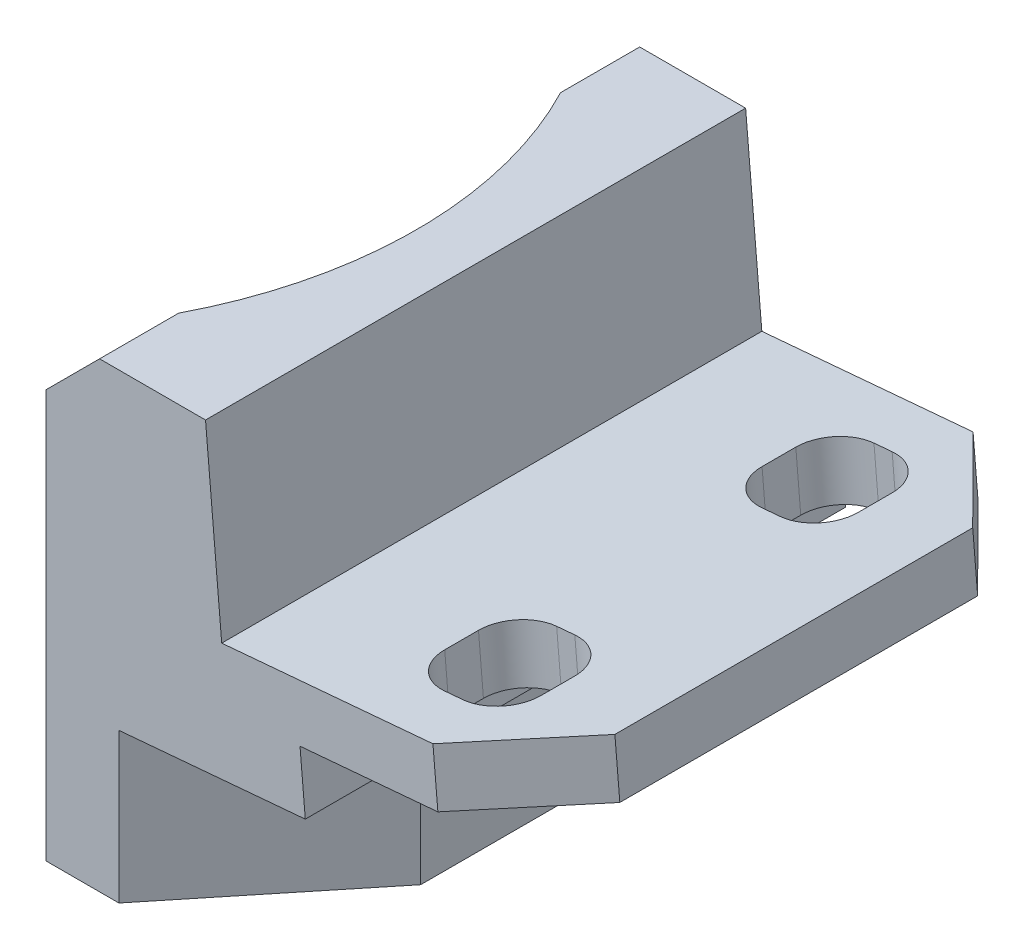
ISO-10303-21;
HEADER;
FILE_DESCRIPTION(('STEP AP214'),'2;1');
FILE_NAME('part.step','',(''),(''),'','','');
FILE_SCHEMA(('AUTOMOTIVE_DESIGN { 1 0 10303 214 1 1 1 1 }'));
ENDSEC;
DATA;
#1=APPLICATION_CONTEXT('core data for automotive mechanical design processes');
#2=APPLICATION_PROTOCOL_DEFINITION('international standard','automotive_design',2000,#1);
#3=PRODUCT_CONTEXT('',#1,'mechanical');
#4=PRODUCT('Part','Part','',(#3));
#5=PRODUCT_RELATED_PRODUCT_CATEGORY('part','',(#4));
#6=PRODUCT_DEFINITION_FORMATION('','',#4);
#7=PRODUCT_DEFINITION_CONTEXT('part definition',#1,'design');
#8=PRODUCT_DEFINITION('design','',#6,#7);
#9=PRODUCT_DEFINITION_SHAPE('','',#8);
#10=(LENGTH_UNIT() NAMED_UNIT(*) SI_UNIT(.MILLI.,.METRE.));
#11=(NAMED_UNIT(*) PLANE_ANGLE_UNIT() SI_UNIT($,.RADIAN.));
#12=(NAMED_UNIT(*) SI_UNIT($,.STERADIAN.) SOLID_ANGLE_UNIT());
#13=UNCERTAINTY_MEASURE_WITH_UNIT(LENGTH_MEASURE(1.E-05),#10,'distance_accuracy_value','');
#14=(GEOMETRIC_REPRESENTATION_CONTEXT(3) GLOBAL_UNCERTAINTY_ASSIGNED_CONTEXT((#13)) GLOBAL_UNIT_ASSIGNED_CONTEXT((#10,
#11,#12)) REPRESENTATION_CONTEXT('',''));
#15=CARTESIAN_POINT('',(0.,0.,0.));
#16=DIRECTION('',(0.,0.,1.));
#17=DIRECTION('',(1.,0.,0.));
#18=AXIS2_PLACEMENT_3D('',#15,#16,#17);
#19=CARTESIAN_POINT('',(20.1295,0.,10.16));
#20=DIRECTION('',(0.,0.,1.));
#21=DIRECTION('',(1.,0.,0.));
#22=AXIS2_PLACEMENT_3D('',#19,#20,#21);
#23=PLANE('',#22);
#24=DIRECTION('',(0.,-1.,0.));
#25=VECTOR('',#24,1.);
#26=CARTESIAN_POINT('',(12.3065392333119,0.,10.16));
#27=LINE('',#26,#25);
#28=CARTESIAN_POINT('',(12.3065392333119,-17.3675753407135,10.16));
#29=VERTEX_POINT('',#28);
#30=CARTESIAN_POINT('',(12.3065392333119,-2.01523509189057,10.16));
#31=VERTEX_POINT('',#30);
#32=EDGE_CURVE('E342',#29,#31,#27,.F.);
#33=ORIENTED_EDGE('',*,*,#32,.F.);
#34=DIRECTION('',(1.,0.,0.));
#35=VECTOR('',#34,1.);
#36=CARTESIAN_POINT('',(20.1295,-17.3675753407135,10.16));
#37=LINE('',#36,#35);
#38=CARTESIAN_POINT('',(15.0495,-17.3675753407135,10.16));
#39=VERTEX_POINT('',#38);
#40=EDGE_CURVE('E61',#29,#39,#37,.T.);
#41=ORIENTED_EDGE('',*,*,#40,.T.);
#42=DIRECTION('',(0.,1.,0.));
#43=VECTOR('',#42,1.);
#44=CARTESIAN_POINT('',(15.0495,-11.2969753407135,10.16));
#45=LINE('',#44,#43);
#46=CARTESIAN_POINT('',(15.0495,-11.7414177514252,10.16));
#47=VERTEX_POINT('',#46);
#48=EDGE_CURVE('E553',#39,#47,#45,.T.);
#49=ORIENTED_EDGE('',*,*,#48,.T.);
#50=DIRECTION('',(0.996194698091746,0.0871557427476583,0.));
#51=VECTOR('',#50,1.);
#52=CARTESIAN_POINT('',(30.6645289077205,-10.3752797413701,10.16));
#53=LINE('',#52,#51);
#54=CARTESIAN_POINT('',(22.0613914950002,-11.1279567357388,10.16));
#55=VERTEX_POINT('',#54);
#56=EDGE_CURVE('E529',#47,#55,#53,.T.);
#57=ORIENTED_EDGE('',*,*,#56,.T.);
#58=DIRECTION('',(0.0871557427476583,-0.996194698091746,0.));
#59=VECTOR('',#58,1.);
#60=CARTESIAN_POINT('',(21.862153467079,-8.85065565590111,10.16));
#61=LINE('',#60,#59);
#62=CARTESIAN_POINT('',(21.862153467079,-8.85065565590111,10.16));
#63=VERTEX_POINT('',#62);
#64=EDGE_CURVE('E357',#63,#55,#61,.T.);
#65=ORIENTED_EDGE('',*,*,#64,.F.);
#66=DIRECTION('',(-0.996194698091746,-0.0871557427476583,0.));
#67=VECTOR('',#66,1.);
#68=CARTESIAN_POINT('',(21.862153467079,-8.85065565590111,10.16));
#69=LINE('',#68,#67);
#70=CARTESIAN_POINT('',(27.0493392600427,-8.39683570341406,10.16));
#71=VERTEX_POINT('',#70);
#72=EDGE_CURVE('E353',#71,#63,#69,.T.);
#73=ORIENTED_EDGE('',*,*,#72,.F.);
#74=DIRECTION('',(-0.0871557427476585,0.996194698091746,0.));
#75=VECTOR('',#74,1.);
#76=CARTESIAN_POINT('',(26.8633837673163,-6.27135469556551,10.16));
#77=LINE('',#76,#75);
#78=CARTESIAN_POINT('',(26.8633837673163,-6.27135469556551,10.16));
#79=VERTEX_POINT('',#78);
#80=EDGE_CURVE('E566',#71,#79,#77,.T.);
#81=ORIENTED_EDGE('',*,*,#80,.T.);
#82=DIRECTION('',(-0.996194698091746,-0.0871557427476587,0.));
#83=VECTOR('',#82,1.);
#84=CARTESIAN_POINT('',(20.1579972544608,-6.858,10.16));
#85=LINE('',#84,#83);
#86=CARTESIAN_POINT('',(18.9170817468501,-6.96656603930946,10.16));
#87=VERTEX_POINT('',#86);
#88=EDGE_CURVE('E533',#79,#87,#85,.T.);
#89=ORIENTED_EDGE('',*,*,#88,.T.);
#90=DIRECTION('',(0.0871557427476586,-0.996194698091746,0.));
#91=VECTOR('',#90,1.);
#92=CARTESIAN_POINT('',(18.2580153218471,0.566597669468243,10.16));
#93=LINE('',#92,#91);
#94=CARTESIAN_POINT('',(18.3075861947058,0.,10.16));
#95=VERTEX_POINT('',#94);
#96=EDGE_CURVE('E496',#95,#87,#93,.T.);
#97=ORIENTED_EDGE('',*,*,#96,.F.);
#98=DIRECTION('',(-1.,0.,0.));
#99=VECTOR('',#98,1.);
#100=CARTESIAN_POINT('',(15.5575,0.,10.16));
#101=LINE('',#100,#99);
#102=CARTESIAN_POINT('',(14.3217743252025,0.,10.16));
#103=VERTEX_POINT('',#102);
#104=EDGE_CURVE('E525',#95,#103,#101,.T.);
#105=ORIENTED_EDGE('',*,*,#104,.T.);
#106=DIRECTION('',(0.707106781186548,0.707106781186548,0.));
#107=VECTOR('',#106,1.);
#108=CARTESIAN_POINT('',(14.3217743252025,0.,10.16));
#109=LINE('',#108,#107);
#110=EDGE_CURVE('E503',#31,#103,#109,.T.);
#111=ORIENTED_EDGE('',*,*,#110,.F.);
#112=EDGE_LOOP('',(#33,#41,#49,#57,#65,#73,#81,#89,#97,#105,#111));
#113=FACE_BOUND('',#112,.T.);
#114=ADVANCED_FACE('F43',(#113),#23,.T.);
#115=CARTESIAN_POINT('',(20.1295,0.,-10.16));
#116=DIRECTION('',(0.,0.,1.));
#117=DIRECTION('',(1.,0.,0.));
#118=AXIS2_PLACEMENT_3D('',#115,#116,#117);
#119=PLANE('',#118);
#120=DIRECTION('',(1.,0.,0.));
#121=VECTOR('',#120,1.);
#122=CARTESIAN_POINT('',(20.1295,-17.3675753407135,-10.16));
#123=LINE('',#122,#121);
#124=CARTESIAN_POINT('',(12.3065392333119,-17.3675753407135,-10.16));
#125=VERTEX_POINT('',#124);
#126=CARTESIAN_POINT('',(15.0495,-17.3675753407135,-10.16));
#127=VERTEX_POINT('',#126);
#128=EDGE_CURVE('E316',#125,#127,#123,.T.);
#129=ORIENTED_EDGE('',*,*,#128,.F.);
#130=DIRECTION('',(0.,-1.,0.));
#131=VECTOR('',#130,1.);
#132=CARTESIAN_POINT('',(12.3065392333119,0.,-10.16));
#133=LINE('',#132,#131);
#134=CARTESIAN_POINT('',(12.3065392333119,-2.01523509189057,-10.16));
#135=VERTEX_POINT('',#134);
#136=EDGE_CURVE('E324',#125,#135,#133,.F.);
#137=ORIENTED_EDGE('',*,*,#136,.T.);
#138=DIRECTION('',(0.707106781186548,0.707106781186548,0.));
#139=VECTOR('',#138,1.);
#140=CARTESIAN_POINT('',(14.3217743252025,0.,-10.16));
#141=LINE('',#140,#139);
#142=CARTESIAN_POINT('',(14.3217743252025,0.,-10.16));
#143=VERTEX_POINT('',#142);
#144=EDGE_CURVE('E507',#135,#143,#141,.T.);
#145=ORIENTED_EDGE('',*,*,#144,.T.);
#146=DIRECTION('',(-1.,0.,0.));
#147=VECTOR('',#146,1.);
#148=CARTESIAN_POINT('',(15.5575,0.,-10.16));
#149=LINE('',#148,#147);
#150=CARTESIAN_POINT('',(18.3075861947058,0.,-10.16));
#151=VERTEX_POINT('',#150);
#152=EDGE_CURVE('E515',#151,#143,#149,.T.);
#153=ORIENTED_EDGE('',*,*,#152,.F.);
#154=DIRECTION('',(-0.0871557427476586,0.996194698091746,0.));
#155=VECTOR('',#154,1.);
#156=CARTESIAN_POINT('',(18.321425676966,-0.158186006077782,-10.16));
#157=LINE('',#156,#155);
#158=CARTESIAN_POINT('',(18.9170817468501,-6.96656603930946,-10.16));
#159=VERTEX_POINT('',#158);
#160=EDGE_CURVE('E563',#159,#151,#157,.T.);
#161=ORIENTED_EDGE('',*,*,#160,.F.);
#162=DIRECTION('',(-0.996194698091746,-0.0871557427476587,0.));
#163=VECTOR('',#162,1.);
#164=CARTESIAN_POINT('',(20.1579972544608,-6.858,-10.16));
#165=LINE('',#164,#163);
#166=CARTESIAN_POINT('',(26.8633837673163,-6.27135469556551,-10.16));
#167=VERTEX_POINT('',#166);
#168=EDGE_CURVE('E522',#167,#159,#165,.T.);
#169=ORIENTED_EDGE('',*,*,#168,.F.);
#170=DIRECTION('',(0.0871557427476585,-0.996194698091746,0.));
#171=VECTOR('',#170,1.);
#172=CARTESIAN_POINT('',(26.2677276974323,0.537025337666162,-10.16));
#173=LINE('',#172,#171);
#174=CARTESIAN_POINT('',(27.0493392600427,-8.39683570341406,-10.16));
#175=VERTEX_POINT('',#174);
#176=EDGE_CURVE('E582',#167,#175,#173,.T.);
#177=ORIENTED_EDGE('',*,*,#176,.T.);
#178=DIRECTION('',(0.996194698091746,0.0871557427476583,0.));
#179=VECTOR('',#178,1.);
#180=CARTESIAN_POINT('',(21.862153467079,-8.85065565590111,-10.16));
#181=LINE('',#180,#179);
#182=CARTESIAN_POINT('',(21.862153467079,-8.85065565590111,-10.16));
#183=VERTEX_POINT('',#182);
#184=EDGE_CURVE('E70',#183,#175,#181,.T.);
#185=ORIENTED_EDGE('',*,*,#184,.F.);
#186=DIRECTION('',(0.0871557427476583,-0.996194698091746,0.));
#187=VECTOR('',#186,1.);
#188=CARTESIAN_POINT('',(21.862153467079,-8.85065565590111,-10.16));
#189=LINE('',#188,#187);
#190=CARTESIAN_POINT('',(22.0613914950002,-11.1279567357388,-10.16));
#191=VERTEX_POINT('',#190);
#192=EDGE_CURVE('E355',#183,#191,#189,.T.);
#193=ORIENTED_EDGE('',*,*,#192,.T.);
#194=DIRECTION('',(0.996194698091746,0.0871557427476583,0.));
#195=VECTOR('',#194,1.);
#196=CARTESIAN_POINT('',(30.6645289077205,-10.3752797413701,-10.16));
#197=LINE('',#196,#195);
#198=CARTESIAN_POINT('',(15.0495,-11.7414177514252,-10.16));
#199=VERTEX_POINT('',#198);
#200=EDGE_CURVE('E519',#199,#191,#197,.T.);
#201=ORIENTED_EDGE('',*,*,#200,.F.);
#202=DIRECTION('',(0.,-1.,0.));
#203=VECTOR('',#202,1.);
#204=CARTESIAN_POINT('',(15.0495,0.,-10.16));
#205=LINE('',#204,#203);
#206=EDGE_CURVE('E327',#199,#127,#205,.T.);
#207=ORIENTED_EDGE('',*,*,#206,.T.);
#208=EDGE_LOOP('',(#129,#137,#145,#153,#161,#169,#177,#185,#193,#201,#207));
#209=FACE_BOUND('',#208,.T.);
#210=ADVANCED_FACE('F323',(#209),#119,.F.);
#211=CARTESIAN_POINT('',(20.1295,-19.4757753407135,10.16));
#212=DIRECTION('',(-1.,0.,0.));
#213=DIRECTION('',(0.,0.,1.));
#214=AXIS2_PLACEMENT_3D('',#211,#212,#213);
#215=PLANE('',#214);
#216=DIRECTION('',(0.,0.,1.));
#217=VECTOR('',#216,1.);
#218=CARTESIAN_POINT('',(20.1295,-17.3675753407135,10.16));
#219=LINE('',#218,#217);
#220=CARTESIAN_POINT('',(20.1295,-17.3675753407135,-3.88672244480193));
#221=VERTEX_POINT('',#220);
#222=CARTESIAN_POINT('',(20.1295,-17.3675753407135,3.88672244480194));
#223=VERTEX_POINT('',#222);
#224=EDGE_CURVE('E746',#221,#223,#219,.T.);
#225=ORIENTED_EDGE('',*,*,#224,.F.);
#226=DIRECTION('',(0.,1.,0.));
#227=VECTOR('',#226,1.);
#228=CARTESIAN_POINT('',(20.1295,-19.4757753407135,-3.88672244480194));
#229=LINE('',#228,#227);
#230=CARTESIAN_POINT('',(20.1295,-11.2969753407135,-3.88672244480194));
#231=VERTEX_POINT('',#230);
#232=EDGE_CURVE('E544',#221,#231,#229,.T.);
#233=ORIENTED_EDGE('',*,*,#232,.T.);
#234=DIRECTION('',(0.,0.,-1.));
#235=VECTOR('',#234,1.);
#236=CARTESIAN_POINT('',(20.1295,-11.2969753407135,10.16));
#237=LINE('',#236,#235);
#238=CARTESIAN_POINT('',(20.1295,-11.2969753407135,3.88672244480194));
#239=VERTEX_POINT('',#238);
#240=EDGE_CURVE('E540',#239,#231,#237,.T.);
#241=ORIENTED_EDGE('',*,*,#240,.F.);
#242=DIRECTION('',(0.,-1.,0.));
#243=VECTOR('',#242,1.);
#244=CARTESIAN_POINT('',(20.1295,-19.4757753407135,3.88672244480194));
#245=LINE('',#244,#243);
#246=EDGE_CURVE('E556',#239,#223,#245,.T.);
#247=ORIENTED_EDGE('',*,*,#246,.T.);
#248=EDGE_LOOP('',(#225,#233,#241,#247));
#249=FACE_BOUND('',#248,.T.);
#250=ADVANCED_FACE('F690',(#249),#215,.F.);
#251=CARTESIAN_POINT('',(20.1295,-19.4757753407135,-3.88672244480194));
#252=DIRECTION('',(-0.77714596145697,0.,0.629320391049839));
#253=DIRECTION('',(0.629320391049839,0.,0.77714596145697));
#254=AXIS2_PLACEMENT_3D('',#251,#252,#253);
#255=PLANE('',#254);
#256=ORIENTED_EDGE('',*,*,#232,.F.);
#257=DIRECTION('',(0.629320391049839,0.,0.77714596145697));
#258=VECTOR('',#257,1.);
#259=CARTESIAN_POINT('',(20.1295,-17.3675753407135,-3.88672244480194));
#260=LINE('',#259,#258);
#261=EDGE_CURVE('E743',#221,#127,#260,.F.);
#262=ORIENTED_EDGE('',*,*,#261,.T.);
#263=ORIENTED_EDGE('',*,*,#206,.F.);
#264=DIRECTION('',(0.628368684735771,0.0549751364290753,0.775970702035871));
#265=VECTOR('',#264,1.);
#266=CARTESIAN_POINT('',(31.1701876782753,-10.3310403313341,9.74739137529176));
#267=LINE('',#266,#265);
#268=EDGE_CURVE('E549',#231,#199,#267,.F.);
#269=ORIENTED_EDGE('',*,*,#268,.F.);
#270=EDGE_LOOP('',(#256,#262,#263,#269));
#271=FACE_BOUND('',#270,.T.);
#272=ADVANCED_FACE('F709',(#271),#255,.F.);
#273=CARTESIAN_POINT('',(15.0495,0.,10.16));
#274=DIRECTION('',(0.77714596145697,0.,0.629320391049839));
#275=DIRECTION('',(0.629320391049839,0.,-0.77714596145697));
#276=AXIS2_PLACEMENT_3D('',#273,#274,#275);
#277=PLANE('',#276);
#278=ORIENTED_EDGE('',*,*,#48,.F.);
#279=DIRECTION('',(0.629320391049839,0.,-0.77714596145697));
#280=VECTOR('',#279,1.);
#281=CARTESIAN_POINT('',(15.0495,-17.3675753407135,10.16));
#282=LINE('',#281,#280);
#283=EDGE_CURVE('E747',#39,#223,#282,.T.);
#284=ORIENTED_EDGE('',*,*,#283,.T.);
#285=ORIENTED_EDGE('',*,*,#246,.F.);
#286=DIRECTION('',(0.628368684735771,0.0549751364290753,-0.775970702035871));
#287=VECTOR('',#286,1.);
#288=CARTESIAN_POINT('',(21.2622432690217,-11.1978731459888,2.48790100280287));
#289=LINE('',#288,#287);
#290=EDGE_CURVE('E560',#47,#239,#289,.T.);
#291=ORIENTED_EDGE('',*,*,#290,.F.);
#292=EDGE_LOOP('',(#278,#284,#285,#291));
#293=FACE_BOUND('',#292,.T.);
#294=ADVANCED_FACE('F717',(#293),#277,.T.);
#295=CARTESIAN_POINT('',(0.508,0.,0.));
#296=DIRECTION('',(0.,-1.,0.));
#297=DIRECTION('',(0.,0.,-1.));
#298=AXIS2_PLACEMENT_3D('',#295,#296,#297);
#299=CYLINDRICAL_SURFACE('',#298,15.5702);
#300=CARTESIAN_POINT('',(0.508,-17.3675753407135,0.));
#301=DIRECTION('',(0.,-1.,0.));
#302=DIRECTION('',(1.,0.,0.));
#303=AXIS2_PLACEMENT_3D('',#300,#301,#302);
#304=CIRCLE('',#303,15.5702);
#305=EDGE_CURVE('E11',#29,#125,#304,.F.);
#306=ORIENTED_EDGE('',*,*,#305,.F.);
#307=ORIENTED_EDGE('',*,*,#32,.T.);
#308=CARTESIAN_POINT('',(0.508,-13.8137743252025,0.));
#309=DIRECTION('',(0.707106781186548,-0.707106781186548,0.));
#310=DIRECTION('',(-0.707106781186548,-0.707106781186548,0.));
#311=AXIS2_PLACEMENT_3D('',#308,#309,#310);
#312=ELLIPSE('',#311,22.0195880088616,15.5702);
#313=CARTESIAN_POINT('',(14.3217743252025,0.,7.18406339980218));
#314=VERTEX_POINT('',#313);
#315=EDGE_CURVE('E759',#314,#31,#312,.T.);
#316=ORIENTED_EDGE('',*,*,#315,.F.);
#317=CARTESIAN_POINT('',(0.508,0.,0.));
#318=DIRECTION('',(0.,-1.,0.));
#319=DIRECTION('',(0.,0.,-1.));
#320=AXIS2_PLACEMENT_3D('',#317,#318,#319);
#321=CIRCLE('',#320,15.5702);
#322=CARTESIAN_POINT('',(14.3217743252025,0.,-7.18406339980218));
#323=VERTEX_POINT('',#322);
#324=EDGE_CURVE('E750',#323,#314,#321,.T.);
#325=ORIENTED_EDGE('',*,*,#324,.F.);
#326=CARTESIAN_POINT('',(0.508,-13.8137743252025,0.));
#327=DIRECTION('',(0.707106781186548,-0.707106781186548,0.));
#328=DIRECTION('',(-0.707106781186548,-0.707106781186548,0.));
#329=AXIS2_PLACEMENT_3D('',#326,#327,#328);
#330=ELLIPSE('',#329,22.0195880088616,15.5702);
#331=EDGE_CURVE('E332',#135,#323,#330,.T.);
#332=ORIENTED_EDGE('',*,*,#331,.F.);
#333=ORIENTED_EDGE('',*,*,#136,.F.);
#334=EDGE_LOOP('',(#306,#307,#316,#325,#332,#333));
#335=FACE_BOUND('',#334,.T.);
#336=ADVANCED_FACE('F330',(#335),#299,.F.);
#337=CARTESIAN_POINT('',(30.2793353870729,-5.97249765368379,10.16));
#338=DIRECTION('',(-0.996194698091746,-0.0871557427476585,0.));
#339=DIRECTION('',(0.0871557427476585,-0.996194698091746,0.));
#340=AXIS2_PLACEMENT_3D('',#337,#338,#339);
#341=PLANE('',#340);
#342=DIRECTION('',(0.,0.,1.));
#343=VECTOR('',#342,1.);
#344=CARTESIAN_POINT('',(30.4652908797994,-8.09797866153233,10.16));
#345=LINE('',#344,#343);
#346=CARTESIAN_POINT('',(30.4652908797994,-8.09797866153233,-6.73099999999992));
#347=VERTEX_POINT('',#346);
#348=CARTESIAN_POINT('',(30.4652908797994,-8.09797866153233,6.73099999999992));
#349=VERTEX_POINT('',#348);
#350=EDGE_CURVE('E350',#347,#349,#345,.T.);
#351=ORIENTED_EDGE('',*,*,#350,.F.);
#352=DIRECTION('',(-0.0871557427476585,0.996194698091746,0.));
#353=VECTOR('',#352,1.);
#354=CARTESIAN_POINT('',(30.2793353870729,-5.97249765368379,-6.731));
#355=LINE('',#354,#353);
#356=CARTESIAN_POINT('',(30.2793353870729,-5.97249765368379,-6.73099999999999));
#357=VERTEX_POINT('',#356);
#358=EDGE_CURVE('E575',#347,#357,#355,.T.);
#359=ORIENTED_EDGE('',*,*,#358,.T.);
#360=DIRECTION('',(0.,0.,-1.));
#361=VECTOR('',#360,1.);
#362=CARTESIAN_POINT('',(30.2793353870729,-5.97249765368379,10.16));
#363=LINE('',#362,#361);
#364=CARTESIAN_POINT('',(30.2793353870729,-5.97249765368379,6.73099999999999));
#365=VERTEX_POINT('',#364);
#366=EDGE_CURVE('E536',#365,#357,#363,.T.);
#367=ORIENTED_EDGE('',*,*,#366,.F.);
#368=DIRECTION('',(0.0871557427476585,-0.996194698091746,0.));
#369=VECTOR('',#368,1.);
#370=CARTESIAN_POINT('',(30.6645289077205,-10.3752797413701,6.73099999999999));
#371=LINE('',#370,#369);
#372=EDGE_CURVE('E578',#365,#349,#371,.T.);
#373=ORIENTED_EDGE('',*,*,#372,.T.);
#374=EDGE_LOOP('',(#351,#359,#367,#373));
#375=FACE_BOUND('',#374,.T.);
#376=ADVANCED_FACE('F699',(#375),#341,.F.);
#377=CARTESIAN_POINT('',(26.2677276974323,0.537025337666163,10.16));
#378=DIRECTION('',(0.70441602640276,0.0616284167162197,0.707106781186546));
#379=DIRECTION('',(0.708453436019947,0.,-0.705757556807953));
#380=AXIS2_PLACEMENT_3D('',#377,#378,#379);
#381=PLANE('',#380);
#382=ORIENTED_EDGE('',*,*,#80,.F.);
#383=DIRECTION('',(0.704416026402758,0.0616284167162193,-0.707106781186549));
#384=VECTOR('',#383,1.);
#385=CARTESIAN_POINT('',(27.0493392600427,-8.39683570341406,10.16));
#386=LINE('',#385,#384);
#387=EDGE_CURVE('E418',#71,#349,#386,.T.);
#388=ORIENTED_EDGE('',*,*,#387,.T.);
#389=ORIENTED_EDGE('',*,*,#372,.F.);
#390=DIRECTION('',(0.704416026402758,0.0616284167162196,-0.707106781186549));
#391=VECTOR('',#390,1.);
#392=CARTESIAN_POINT('',(26.8633837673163,-6.27135469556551,10.16));
#393=LINE('',#392,#391);
#394=EDGE_CURVE('E572',#79,#365,#393,.T.);
#395=ORIENTED_EDGE('',*,*,#394,.F.);
#396=EDGE_LOOP('',(#382,#388,#389,#395));
#397=FACE_BOUND('',#396,.T.);
#398=ADVANCED_FACE('F702',(#397),#381,.T.);
#399=CARTESIAN_POINT('',(30.2793353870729,-5.97249765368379,-6.731));
#400=DIRECTION('',(-0.704416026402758,-0.0616284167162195,0.707106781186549));
#401=DIRECTION('',(0.708453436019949,0.,0.705757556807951));
#402=AXIS2_PLACEMENT_3D('',#399,#400,#401);
#403=PLANE('',#402);
#404=ORIENTED_EDGE('',*,*,#358,.F.);
#405=DIRECTION('',(0.70441602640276,0.0616284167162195,0.707106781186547));
#406=VECTOR('',#405,1.);
#407=CARTESIAN_POINT('',(30.4652908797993,-8.09797866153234,-6.731));
#408=LINE('',#407,#406);
#409=EDGE_CURVE('E415',#347,#175,#408,.F.);
#410=ORIENTED_EDGE('',*,*,#409,.T.);
#411=ORIENTED_EDGE('',*,*,#176,.F.);
#412=DIRECTION('',(0.70441602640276,0.0616284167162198,0.707106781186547));
#413=VECTOR('',#412,1.);
#414=CARTESIAN_POINT('',(30.2793353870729,-5.97249765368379,-6.731));
#415=LINE('',#414,#413);
#416=EDGE_CURVE('E569',#357,#167,#415,.F.);
#417=ORIENTED_EDGE('',*,*,#416,.F.);
#418=EDGE_LOOP('',(#404,#410,#411,#417));
#419=FACE_BOUND('',#418,.T.);
#420=ADVANCED_FACE('F45',(#419),#403,.F.);
#421=CARTESIAN_POINT('',(25.2427902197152,1.17768629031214,6.604));
#422=DIRECTION('',(0.0871557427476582,-0.996194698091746,0.));
#423=DIRECTION('',(0.996194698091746,0.0871557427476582,0.));
#424=AXIS2_PLACEMENT_3D('',#421,#422,#423);
#425=CYLINDRICAL_SURFACE('',#424,1.4732);
#426=CARTESIAN_POINT('',(26.0878121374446,-8.4809584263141,6.604));
#427=DIRECTION('',(0.0871557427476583,-0.996194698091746,0.));
#428=DIRECTION('',(0.996194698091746,0.0871557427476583,0.));
#429=AXIS2_PLACEMENT_3D('',#426,#427,#428);
#430=CIRCLE('',#429,1.4732);
#431=CARTESIAN_POINT('',(26.0878121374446,-8.4809584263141,8.0772));
#432=VERTEX_POINT('',#431);
#433=CARTESIAN_POINT('',(27.5554061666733,-8.35256058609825,6.60399999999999));
#434=VERTEX_POINT('',#433);
#435=EDGE_CURVE('E409',#432,#434,#430,.F.);
#436=ORIENTED_EDGE('',*,*,#435,.F.);
#437=DIRECTION('',(0.0871557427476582,-0.996194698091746,0.));
#438=VECTOR('',#437,1.);
#439=CARTESIAN_POINT('',(25.2427902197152,1.17768629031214,8.0772));
#440=LINE('',#439,#438);
#441=CARTESIAN_POINT('',(25.9018566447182,-6.35547741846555,8.0772));
#442=VERTEX_POINT('',#441);
#443=EDGE_CURVE('E457',#442,#432,#440,.T.);
#444=ORIENTED_EDGE('',*,*,#443,.F.);
#445=CARTESIAN_POINT('',(25.9018566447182,-6.35547741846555,6.604));
#446=DIRECTION('',(0.0871557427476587,-0.996194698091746,0.));
#447=DIRECTION('',(0.996194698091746,0.0871557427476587,0.));
#448=AXIS2_PLACEMENT_3D('',#445,#446,#447);
#449=CIRCLE('',#448,1.4732);
#450=CARTESIAN_POINT('',(27.3694506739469,-6.2270795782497,6.60399999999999));
#451=VERTEX_POINT('',#450);
#452=EDGE_CURVE('E594',#451,#442,#449,.T.);
#453=ORIENTED_EDGE('',*,*,#452,.F.);
#454=DIRECTION('',(0.0871557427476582,-0.996194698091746,0.));
#455=VECTOR('',#454,1.);
#456=CARTESIAN_POINT('',(26.710384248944,1.30608413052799,6.60399999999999));
#457=LINE('',#456,#455);
#458=EDGE_CURVE('E458',#451,#434,#457,.T.);
#459=ORIENTED_EDGE('',*,*,#458,.T.);
#460=EDGE_LOOP('',(#436,#444,#453,#459));
#461=FACE_BOUND('',#460,.T.);
#462=ADVANCED_FACE('F726',(#461),#425,.F.);
#463=CARTESIAN_POINT('',(26.710384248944,1.30608413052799,6.60399999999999));
#464=DIRECTION('',(0.996194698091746,0.0871557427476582,0.));
#465=DIRECTION('',(-0.0871557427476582,0.996194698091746,0.));
#466=AXIS2_PLACEMENT_3D('',#463,#464,#465);
#467=PLANE('',#466);
#468=DIRECTION('',(0.,0.,-1.));
#469=VECTOR('',#468,1.);
#470=CARTESIAN_POINT('',(27.5554061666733,-8.35256058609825,6.60399999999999));
#471=LINE('',#470,#469);
#472=CARTESIAN_POINT('',(27.5554061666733,-8.35256058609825,5.33400000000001));
#473=VERTEX_POINT('',#472);
#474=EDGE_CURVE('E406',#434,#473,#471,.T.);
#475=ORIENTED_EDGE('',*,*,#474,.F.);
#476=ORIENTED_EDGE('',*,*,#458,.F.);
#477=DIRECTION('',(0.,0.,1.));
#478=VECTOR('',#477,1.);
#479=CARTESIAN_POINT('',(27.3694506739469,-6.2270795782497,10.16));
#480=LINE('',#479,#478);
#481=CARTESIAN_POINT('',(27.3694506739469,-6.2270795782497,5.33400000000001));
#482=VERTEX_POINT('',#481);
#483=EDGE_CURVE('E610',#482,#451,#480,.T.);
#484=ORIENTED_EDGE('',*,*,#483,.F.);
#485=DIRECTION('',(0.0871557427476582,-0.996194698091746,0.));
#486=VECTOR('',#485,1.);
#487=CARTESIAN_POINT('',(26.710384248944,1.30608413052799,5.33400000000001));
#488=LINE('',#487,#486);
#489=EDGE_CURVE('E463',#482,#473,#488,.T.);
#490=ORIENTED_EDGE('',*,*,#489,.T.);
#491=EDGE_LOOP('',(#475,#476,#484,#490));
#492=FACE_BOUND('',#491,.T.);
#493=ADVANCED_FACE('F818',(#492),#467,.F.);
#494=CARTESIAN_POINT('',(25.2427902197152,1.17768629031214,5.334));
#495=DIRECTION('',(0.0871557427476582,-0.996194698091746,0.));
#496=DIRECTION('',(0.996194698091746,0.0871557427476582,0.));
#497=AXIS2_PLACEMENT_3D('',#494,#495,#496);
#498=CYLINDRICAL_SURFACE('',#497,1.4732);
#499=CARTESIAN_POINT('',(26.0878121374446,-8.4809584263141,5.334));
#500=DIRECTION('',(0.0871557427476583,-0.996194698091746,0.));
#501=DIRECTION('',(0.996194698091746,0.0871557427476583,0.));
#502=AXIS2_PLACEMENT_3D('',#499,#500,#501);
#503=CIRCLE('',#502,1.4732);
#504=CARTESIAN_POINT('',(26.0878121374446,-8.4809584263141,3.8608));
#505=VERTEX_POINT('',#504);
#506=EDGE_CURVE('E403',#473,#505,#503,.F.);
#507=ORIENTED_EDGE('',*,*,#506,.F.);
#508=ORIENTED_EDGE('',*,*,#489,.F.);
#509=CARTESIAN_POINT('',(25.9018566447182,-6.35547741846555,5.334));
#510=DIRECTION('',(0.0871557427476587,-0.996194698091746,0.));
#511=DIRECTION('',(0.996194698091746,0.0871557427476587,0.));
#512=AXIS2_PLACEMENT_3D('',#509,#510,#511);
#513=CIRCLE('',#512,1.4732);
#514=CARTESIAN_POINT('',(25.9018566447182,-6.35547741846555,3.8608));
#515=VERTEX_POINT('',#514);
#516=EDGE_CURVE('E606',#515,#482,#513,.T.);
#517=ORIENTED_EDGE('',*,*,#516,.F.);
#518=DIRECTION('',(0.0871557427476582,-0.996194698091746,0.));
#519=VECTOR('',#518,1.);
#520=CARTESIAN_POINT('',(25.2427902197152,1.17768629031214,3.8608));
#521=LINE('',#520,#519);
#522=EDGE_CURVE('E467',#515,#505,#521,.T.);
#523=ORIENTED_EDGE('',*,*,#522,.T.);
#524=EDGE_LOOP('',(#507,#508,#517,#523));
#525=FACE_BOUND('',#524,.T.);
#526=ADVANCED_FACE('F792',(#525),#498,.F.);
#527=CARTESIAN_POINT('',(25.2427902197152,1.17768629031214,3.8608));
#528=DIRECTION('',(0.,0.,-1.));
#529=DIRECTION('',(-1.,0.,0.));
#530=AXIS2_PLACEMENT_3D('',#527,#528,#529);
#531=PLANE('',#530);
#532=DIRECTION('',(-0.996194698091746,-0.0871557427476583,0.));
#533=VECTOR('',#532,1.);
#534=CARTESIAN_POINT('',(26.0878121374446,-8.4809584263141,3.8608));
#535=LINE('',#534,#533);
#536=CARTESIAN_POINT('',(25.4046218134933,-8.54072983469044,3.8608));
#537=VERTEX_POINT('',#536);
#538=EDGE_CURVE('E400',#505,#537,#535,.T.);
#539=ORIENTED_EDGE('',*,*,#538,.F.);
#540=ORIENTED_EDGE('',*,*,#522,.F.);
#541=DIRECTION('',(0.996194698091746,0.0871557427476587,0.));
#542=VECTOR('',#541,1.);
#543=CARTESIAN_POINT('',(20.1579972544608,-6.858,3.8608));
#544=LINE('',#543,#542);
#545=CARTESIAN_POINT('',(25.2186663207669,-6.41524882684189,3.8608));
#546=VERTEX_POINT('',#545);
#547=EDGE_CURVE('E602',#546,#515,#544,.T.);
#548=ORIENTED_EDGE('',*,*,#547,.F.);
#549=DIRECTION('',(0.0871557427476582,-0.996194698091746,0.));
#550=VECTOR('',#549,1.);
#551=CARTESIAN_POINT('',(24.5595998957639,1.1179148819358,3.8608));
#552=LINE('',#551,#550);
#553=EDGE_CURVE('E471',#546,#537,#552,.T.);
#554=ORIENTED_EDGE('',*,*,#553,.T.);
#555=EDGE_LOOP('',(#539,#540,#548,#554));
#556=FACE_BOUND('',#555,.T.);
#557=ADVANCED_FACE('F795',(#556),#531,.F.);
#558=CARTESIAN_POINT('',(24.5595998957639,1.1179148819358,5.334));
#559=DIRECTION('',(0.0871557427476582,-0.996194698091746,0.));
#560=DIRECTION('',(0.996194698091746,0.0871557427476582,0.));
#561=AXIS2_PLACEMENT_3D('',#558,#559,#560);
#562=CYLINDRICAL_SURFACE('',#561,1.4732);
#563=CARTESIAN_POINT('',(25.4046218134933,-8.54072983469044,5.334));
#564=DIRECTION('',(0.0871557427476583,-0.996194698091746,0.));
#565=DIRECTION('',(0.996194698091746,0.0871557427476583,0.));
#566=AXIS2_PLACEMENT_3D('',#563,#564,#565);
#567=CIRCLE('',#566,1.4732);
#568=CARTESIAN_POINT('',(23.9370277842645,-8.66912767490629,5.334));
#569=VERTEX_POINT('',#568);
#570=EDGE_CURVE('E397',#537,#569,#567,.F.);
#571=ORIENTED_EDGE('',*,*,#570,.F.);
#572=ORIENTED_EDGE('',*,*,#553,.F.);
#573=CARTESIAN_POINT('',(25.2186663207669,-6.41524882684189,5.334));
#574=DIRECTION('',(0.0871557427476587,-0.996194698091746,0.));
#575=DIRECTION('',(0.996194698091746,0.0871557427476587,0.));
#576=AXIS2_PLACEMENT_3D('',#573,#574,#575);
#577=CIRCLE('',#576,1.4732);
#578=CARTESIAN_POINT('',(23.7510722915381,-6.54364666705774,5.334));
#579=VERTEX_POINT('',#578);
#580=EDGE_CURVE('E598',#579,#546,#577,.T.);
#581=ORIENTED_EDGE('',*,*,#580,.F.);
#582=DIRECTION('',(0.0871557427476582,-0.996194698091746,0.));
#583=VECTOR('',#582,1.);
#584=CARTESIAN_POINT('',(23.0920058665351,0.989517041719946,5.334));
#585=LINE('',#584,#583);
#586=EDGE_CURVE('E475',#579,#569,#585,.T.);
#587=ORIENTED_EDGE('',*,*,#586,.T.);
#588=EDGE_LOOP('',(#571,#572,#581,#587));
#589=FACE_BOUND('',#588,.T.);
#590=ADVANCED_FACE('F800',(#589),#562,.F.);
#591=CARTESIAN_POINT('',(24.5595998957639,1.1179148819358,6.604));
#592=DIRECTION('',(0.0871557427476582,-0.996194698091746,0.));
#593=DIRECTION('',(0.996194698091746,0.0871557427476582,0.));
#594=AXIS2_PLACEMENT_3D('',#591,#592,#593);
#595=CYLINDRICAL_SURFACE('',#594,1.4732);
#596=CARTESIAN_POINT('',(25.4046218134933,-8.54072983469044,6.604));
#597=DIRECTION('',(0.0871557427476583,-0.996194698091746,0.));
#598=DIRECTION('',(0.996194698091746,0.0871557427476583,0.));
#599=AXIS2_PLACEMENT_3D('',#596,#597,#598);
#600=CIRCLE('',#599,1.4732);
#601=CARTESIAN_POINT('',(23.9370277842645,-8.66912767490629,6.604));
#602=VERTEX_POINT('',#601);
#603=CARTESIAN_POINT('',(25.4046218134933,-8.54072983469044,8.0772));
#604=VERTEX_POINT('',#603);
#605=EDGE_CURVE('E394',#602,#604,#600,.F.);
#606=ORIENTED_EDGE('',*,*,#605,.F.);
#607=DIRECTION('',(0.0871557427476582,-0.996194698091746,0.));
#608=VECTOR('',#607,1.);
#609=CARTESIAN_POINT('',(23.0920058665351,0.989517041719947,6.604));
#610=LINE('',#609,#608);
#611=CARTESIAN_POINT('',(23.7510722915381,-6.54364666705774,6.604));
#612=VERTEX_POINT('',#611);
#613=EDGE_CURVE('E479',#612,#602,#610,.T.);
#614=ORIENTED_EDGE('',*,*,#613,.F.);
#615=CARTESIAN_POINT('',(25.2186663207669,-6.41524882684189,6.604));
#616=DIRECTION('',(0.0871557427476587,-0.996194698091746,0.));
#617=DIRECTION('',(0.996194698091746,0.0871557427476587,0.));
#618=AXIS2_PLACEMENT_3D('',#615,#616,#617);
#619=CIRCLE('',#618,1.4732);
#620=CARTESIAN_POINT('',(25.2186663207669,-6.41524882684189,8.0772));
#621=VERTEX_POINT('',#620);
#622=EDGE_CURVE('E590',#621,#612,#619,.T.);
#623=ORIENTED_EDGE('',*,*,#622,.F.);
#624=DIRECTION('',(0.0871557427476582,-0.996194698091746,0.));
#625=VECTOR('',#624,1.);
#626=CARTESIAN_POINT('',(24.5595998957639,1.1179148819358,8.0772));
#627=LINE('',#626,#625);
#628=EDGE_CURVE('E483',#621,#604,#627,.T.);
#629=ORIENTED_EDGE('',*,*,#628,.T.);
#630=EDGE_LOOP('',(#606,#614,#623,#629));
#631=FACE_BOUND('',#630,.T.);
#632=ADVANCED_FACE('F808',(#631),#595,.F.);
#633=CARTESIAN_POINT('',(25.2427902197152,1.17768629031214,8.0772));
#634=DIRECTION('',(0.,0.,1.));
#635=DIRECTION('',(1.,0.,0.));
#636=AXIS2_PLACEMENT_3D('',#633,#634,#635);
#637=PLANE('',#636);
#638=DIRECTION('',(0.996194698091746,0.0871557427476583,0.));
#639=VECTOR('',#638,1.);
#640=CARTESIAN_POINT('',(26.0878121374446,-8.4809584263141,8.0772));
#641=LINE('',#640,#639);
#642=EDGE_CURVE('E412',#604,#432,#641,.T.);
#643=ORIENTED_EDGE('',*,*,#642,.F.);
#644=ORIENTED_EDGE('',*,*,#628,.F.);
#645=DIRECTION('',(-0.996194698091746,-0.0871557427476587,0.));
#646=VECTOR('',#645,1.);
#647=CARTESIAN_POINT('',(20.1579972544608,-6.858,8.0772));
#648=LINE('',#647,#646);
#649=EDGE_CURVE('E586',#442,#621,#648,.T.);
#650=ORIENTED_EDGE('',*,*,#649,.F.);
#651=ORIENTED_EDGE('',*,*,#443,.T.);
#652=EDGE_LOOP('',(#643,#644,#650,#651));
#653=FACE_BOUND('',#652,.T.);
#654=ADVANCED_FACE('F811',(#653),#637,.F.);
#655=CARTESIAN_POINT('',(23.0920058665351,0.989517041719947,6.604));
#656=DIRECTION('',(-0.996194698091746,-0.0871557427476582,0.));
#657=DIRECTION('',(0.0871557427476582,-0.996194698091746,0.));
#658=AXIS2_PLACEMENT_3D('',#655,#656,#657);
#659=PLANE('',#658);
#660=DIRECTION('',(0.,0.,1.));
#661=VECTOR('',#660,1.);
#662=CARTESIAN_POINT('',(23.9370277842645,-8.66912767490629,6.604));
#663=LINE('',#662,#661);
#664=EDGE_CURVE('E391',#569,#602,#663,.T.);
#665=ORIENTED_EDGE('',*,*,#664,.F.);
#666=ORIENTED_EDGE('',*,*,#586,.F.);
#667=DIRECTION('',(0.,0.,-1.));
#668=VECTOR('',#667,1.);
#669=CARTESIAN_POINT('',(23.7510722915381,-6.54364666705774,10.16));
#670=LINE('',#669,#668);
#671=EDGE_CURVE('E462',#612,#579,#670,.T.);
#672=ORIENTED_EDGE('',*,*,#671,.F.);
#673=ORIENTED_EDGE('',*,*,#613,.T.);
#674=EDGE_LOOP('',(#665,#666,#672,#673));
#675=FACE_BOUND('',#674,.T.);
#676=ADVANCED_FACE('F681',(#675),#659,.F.);
#677=CARTESIAN_POINT('',(25.2427902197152,1.17768629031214,-6.604));
#678=DIRECTION('',(0.0871557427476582,-0.996194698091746,0.));
#679=DIRECTION('',(0.996194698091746,0.0871557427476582,0.));
#680=AXIS2_PLACEMENT_3D('',#677,#678,#679);
#681=CYLINDRICAL_SURFACE('',#680,1.4732);
#682=DIRECTION('',(0.0871557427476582,-0.996194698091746,0.));
#683=VECTOR('',#682,1.);
#684=CARTESIAN_POINT('',(25.2427902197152,1.17768629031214,-8.0772));
#685=LINE('',#684,#683);
#686=CARTESIAN_POINT('',(25.9018566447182,-6.35547741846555,-8.0772));
#687=VERTEX_POINT('',#686);
#688=CARTESIAN_POINT('',(26.0878121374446,-8.4809584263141,-8.0772));
#689=VERTEX_POINT('',#688);
#690=EDGE_CURVE('E423',#687,#689,#685,.T.);
#691=ORIENTED_EDGE('',*,*,#690,.T.);
#692=CARTESIAN_POINT('',(26.0878121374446,-8.4809584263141,-6.604));
#693=DIRECTION('',(0.0871557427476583,-0.996194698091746,0.));
#694=DIRECTION('',(0.996194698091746,0.0871557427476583,0.));
#695=AXIS2_PLACEMENT_3D('',#692,#693,#694);
#696=CIRCLE('',#695,1.4732);
#697=CARTESIAN_POINT('',(27.5554061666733,-8.35256058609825,-6.60399999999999));
#698=VERTEX_POINT('',#697);
#699=EDGE_CURVE('E375',#689,#698,#696,.T.);
#700=ORIENTED_EDGE('',*,*,#699,.T.);
#701=DIRECTION('',(0.0871557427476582,-0.996194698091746,0.));
#702=VECTOR('',#701,1.);
#703=CARTESIAN_POINT('',(26.710384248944,1.30608413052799,-6.60399999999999));
#704=LINE('',#703,#702);
#705=CARTESIAN_POINT('',(27.3694506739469,-6.2270795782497,-6.60399999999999));
#706=VERTEX_POINT('',#705);
#707=EDGE_CURVE('E422',#706,#698,#704,.T.);
#708=ORIENTED_EDGE('',*,*,#707,.F.);
#709=CARTESIAN_POINT('',(25.9018566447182,-6.35547741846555,-6.604));
#710=DIRECTION('',(0.0871557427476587,-0.996194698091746,0.));
#711=DIRECTION('',(0.996194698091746,0.0871557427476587,0.));
#712=AXIS2_PLACEMENT_3D('',#709,#710,#711);
#713=CIRCLE('',#712,1.4732);
#714=EDGE_CURVE('E633',#706,#687,#713,.F.);
#715=ORIENTED_EDGE('',*,*,#714,.T.);
#716=EDGE_LOOP('',(#691,#700,#708,#715));
#717=FACE_BOUND('',#716,.T.);
#718=ADVANCED_FACE('F670',(#717),#681,.F.);
#719=CARTESIAN_POINT('',(25.2427902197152,1.17768629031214,-8.0772));
#720=DIRECTION('',(0.,0.,1.));
#721=DIRECTION('',(1.,0.,0.));
#722=AXIS2_PLACEMENT_3D('',#719,#720,#721);
#723=PLANE('',#722);
#724=DIRECTION('',(0.0871557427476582,-0.996194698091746,0.));
#725=VECTOR('',#724,1.);
#726=CARTESIAN_POINT('',(24.5595998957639,1.1179148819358,-8.0772));
#727=LINE('',#726,#725);
#728=CARTESIAN_POINT('',(25.2186663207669,-6.41524882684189,-8.0772));
#729=VERTEX_POINT('',#728);
#730=CARTESIAN_POINT('',(25.4046218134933,-8.54072983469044,-8.0772));
#731=VERTEX_POINT('',#730);
#732=EDGE_CURVE('E428',#729,#731,#727,.T.);
#733=ORIENTED_EDGE('',*,*,#732,.T.);
#734=DIRECTION('',(0.996194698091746,0.0871557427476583,0.));
#735=VECTOR('',#734,1.);
#736=CARTESIAN_POINT('',(26.0878121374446,-8.4809584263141,-8.0772));
#737=LINE('',#736,#735);
#738=EDGE_CURVE('E371',#731,#689,#737,.T.);
#739=ORIENTED_EDGE('',*,*,#738,.T.);
#740=ORIENTED_EDGE('',*,*,#690,.F.);
#741=DIRECTION('',(-0.996194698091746,-0.0871557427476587,0.));
#742=VECTOR('',#741,1.);
#743=CARTESIAN_POINT('',(20.1579972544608,-6.858,-8.0772));
#744=LINE('',#743,#742);
#745=EDGE_CURVE('E630',#687,#729,#744,.T.);
#746=ORIENTED_EDGE('',*,*,#745,.T.);
#747=EDGE_LOOP('',(#733,#739,#740,#746));
#748=FACE_BOUND('',#747,.T.);
#749=ADVANCED_FACE('F673',(#748),#723,.T.);
#750=CARTESIAN_POINT('',(24.5595998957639,1.1179148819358,-6.604));
#751=DIRECTION('',(0.0871557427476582,-0.996194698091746,0.));
#752=DIRECTION('',(0.996194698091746,0.0871557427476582,0.));
#753=AXIS2_PLACEMENT_3D('',#750,#751,#752);
#754=CYLINDRICAL_SURFACE('',#753,1.4732);
#755=DIRECTION('',(0.0871557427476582,-0.996194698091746,0.));
#756=VECTOR('',#755,1.);
#757=CARTESIAN_POINT('',(23.0920058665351,0.989517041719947,-6.604));
#758=LINE('',#757,#756);
#759=CARTESIAN_POINT('',(23.7510722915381,-6.54364666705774,-6.604));
#760=VERTEX_POINT('',#759);
#761=CARTESIAN_POINT('',(23.9370277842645,-8.66912767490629,-6.604));
#762=VERTEX_POINT('',#761);
#763=EDGE_CURVE('E432',#760,#762,#758,.T.);
#764=ORIENTED_EDGE('',*,*,#763,.T.);
#765=CARTESIAN_POINT('',(25.4046218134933,-8.54072983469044,-6.604));
#766=DIRECTION('',(0.0871557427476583,-0.996194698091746,0.));
#767=DIRECTION('',(0.996194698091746,0.0871557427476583,0.));
#768=AXIS2_PLACEMENT_3D('',#765,#766,#767);
#769=CIRCLE('',#768,1.4732);
#770=EDGE_CURVE('E367',#762,#731,#769,.T.);
#771=ORIENTED_EDGE('',*,*,#770,.T.);
#772=ORIENTED_EDGE('',*,*,#732,.F.);
#773=CARTESIAN_POINT('',(25.2186663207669,-6.41524882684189,-6.604));
#774=DIRECTION('',(0.0871557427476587,-0.996194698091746,0.));
#775=DIRECTION('',(0.996194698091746,0.0871557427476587,0.));
#776=AXIS2_PLACEMENT_3D('',#773,#774,#775);
#777=CIRCLE('',#776,1.4732);
#778=EDGE_CURVE('E627',#729,#760,#777,.F.);
#779=ORIENTED_EDGE('',*,*,#778,.T.);
#780=EDGE_LOOP('',(#764,#771,#772,#779));
#781=FACE_BOUND('',#780,.T.);
#782=ADVANCED_FACE('F645',(#781),#754,.F.);
#783=CARTESIAN_POINT('',(24.5595998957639,1.1179148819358,-5.334));
#784=DIRECTION('',(0.0871557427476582,-0.996194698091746,0.));
#785=DIRECTION('',(0.996194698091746,0.0871557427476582,0.));
#786=AXIS2_PLACEMENT_3D('',#783,#784,#785);
#787=CYLINDRICAL_SURFACE('',#786,1.4732);
#788=DIRECTION('',(0.0871557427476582,-0.996194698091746,0.));
#789=VECTOR('',#788,1.);
#790=CARTESIAN_POINT('',(24.5595998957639,1.1179148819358,-3.8608));
#791=LINE('',#790,#789);
#792=CARTESIAN_POINT('',(25.2186663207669,-6.41524882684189,-3.8608));
#793=VERTEX_POINT('',#792);
#794=CARTESIAN_POINT('',(25.4046218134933,-8.54072983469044,-3.8608));
#795=VERTEX_POINT('',#794);
#796=EDGE_CURVE('E440',#793,#795,#791,.T.);
#797=ORIENTED_EDGE('',*,*,#796,.T.);
#798=CARTESIAN_POINT('',(25.4046218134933,-8.54072983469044,-5.334));
#799=DIRECTION('',(0.0871557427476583,-0.996194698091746,0.));
#800=DIRECTION('',(0.996194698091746,0.0871557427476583,0.));
#801=AXIS2_PLACEMENT_3D('',#798,#799,#800);
#802=CIRCLE('',#801,1.4732);
#803=CARTESIAN_POINT('',(23.9370277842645,-8.66912767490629,-5.334));
#804=VERTEX_POINT('',#803);
#805=EDGE_CURVE('E360',#795,#804,#802,.T.);
#806=ORIENTED_EDGE('',*,*,#805,.T.);
#807=DIRECTION('',(0.0871557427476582,-0.996194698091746,0.));
#808=VECTOR('',#807,1.);
#809=CARTESIAN_POINT('',(23.0920058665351,0.989517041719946,-5.334));
#810=LINE('',#809,#808);
#811=CARTESIAN_POINT('',(23.7510722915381,-6.54364666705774,-5.334));
#812=VERTEX_POINT('',#811);
#813=EDGE_CURVE('E436',#812,#804,#810,.T.);
#814=ORIENTED_EDGE('',*,*,#813,.F.);
#815=CARTESIAN_POINT('',(25.2186663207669,-6.41524882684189,-5.334));
#816=DIRECTION('',(0.0871557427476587,-0.996194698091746,0.));
#817=DIRECTION('',(0.996194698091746,0.0871557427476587,0.));
#818=AXIS2_PLACEMENT_3D('',#815,#816,#817);
#819=CIRCLE('',#818,1.4732);
#820=EDGE_CURVE('E624',#812,#793,#819,.F.);
#821=ORIENTED_EDGE('',*,*,#820,.T.);
#822=EDGE_LOOP('',(#797,#806,#814,#821));
#823=FACE_BOUND('',#822,.T.);
#824=ADVANCED_FACE('F655',(#823),#787,.F.);
#825=CARTESIAN_POINT('',(25.2427902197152,1.17768629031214,-3.8608));
#826=DIRECTION('',(0.,0.,-1.));
#827=DIRECTION('',(-1.,0.,0.));
#828=AXIS2_PLACEMENT_3D('',#825,#826,#827);
#829=PLANE('',#828);
#830=DIRECTION('',(0.0871557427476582,-0.996194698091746,0.));
#831=VECTOR('',#830,1.);
#832=CARTESIAN_POINT('',(25.2427902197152,1.17768629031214,-3.8608));
#833=LINE('',#832,#831);
#834=CARTESIAN_POINT('',(25.9018566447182,-6.35547741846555,-3.8608));
#835=VERTEX_POINT('',#834);
#836=CARTESIAN_POINT('',(26.0878121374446,-8.4809584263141,-3.8608));
#837=VERTEX_POINT('',#836);
#838=EDGE_CURVE('E444',#835,#837,#833,.T.);
#839=ORIENTED_EDGE('',*,*,#838,.T.);
#840=DIRECTION('',(-0.996194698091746,-0.0871557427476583,0.));
#841=VECTOR('',#840,1.);
#842=CARTESIAN_POINT('',(26.0878121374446,-8.4809584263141,-3.8608));
#843=LINE('',#842,#841);
#844=EDGE_CURVE('E387',#837,#795,#843,.T.);
#845=ORIENTED_EDGE('',*,*,#844,.T.);
#846=ORIENTED_EDGE('',*,*,#796,.F.);
#847=DIRECTION('',(0.996194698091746,0.0871557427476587,0.));
#848=VECTOR('',#847,1.);
#849=CARTESIAN_POINT('',(20.1579972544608,-6.858,-3.8608));
#850=LINE('',#849,#848);
#851=EDGE_CURVE('E621',#793,#835,#850,.T.);
#852=ORIENTED_EDGE('',*,*,#851,.T.);
#853=EDGE_LOOP('',(#839,#845,#846,#852));
#854=FACE_BOUND('',#853,.T.);
#855=ADVANCED_FACE('F660',(#854),#829,.T.);
#856=CARTESIAN_POINT('',(25.2427902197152,1.17768629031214,-5.334));
#857=DIRECTION('',(0.0871557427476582,-0.996194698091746,0.));
#858=DIRECTION('',(0.996194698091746,0.0871557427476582,0.));
#859=AXIS2_PLACEMENT_3D('',#856,#857,#858);
#860=CYLINDRICAL_SURFACE('',#859,1.4732);
#861=DIRECTION('',(0.0871557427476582,-0.996194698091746,0.));
#862=VECTOR('',#861,1.);
#863=CARTESIAN_POINT('',(26.710384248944,1.30608413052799,-5.33400000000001));
#864=LINE('',#863,#862);
#865=CARTESIAN_POINT('',(27.3694506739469,-6.2270795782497,-5.33400000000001));
#866=VERTEX_POINT('',#865);
#867=CARTESIAN_POINT('',(27.5554061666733,-8.35256058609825,-5.33400000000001));
#868=VERTEX_POINT('',#867);
#869=EDGE_CURVE('E448',#866,#868,#864,.T.);
#870=ORIENTED_EDGE('',*,*,#869,.T.);
#871=CARTESIAN_POINT('',(26.0878121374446,-8.4809584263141,-5.334));
#872=DIRECTION('',(0.0871557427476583,-0.996194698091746,0.));
#873=DIRECTION('',(0.996194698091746,0.0871557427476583,0.));
#874=AXIS2_PLACEMENT_3D('',#871,#872,#873);
#875=CIRCLE('',#874,1.4732);
#876=EDGE_CURVE('E383',#868,#837,#875,.T.);
#877=ORIENTED_EDGE('',*,*,#876,.T.);
#878=ORIENTED_EDGE('',*,*,#838,.F.);
#879=CARTESIAN_POINT('',(25.9018566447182,-6.35547741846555,-5.334));
#880=DIRECTION('',(0.0871557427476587,-0.996194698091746,0.));
#881=DIRECTION('',(0.996194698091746,0.0871557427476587,0.));
#882=AXIS2_PLACEMENT_3D('',#879,#880,#881);
#883=CIRCLE('',#882,1.4732);
#884=EDGE_CURVE('E617',#835,#866,#883,.F.);
#885=ORIENTED_EDGE('',*,*,#884,.T.);
#886=EDGE_LOOP('',(#870,#877,#878,#885));
#887=FACE_BOUND('',#886,.T.);
#888=ADVANCED_FACE('F664',(#887),#860,.F.);
#889=CARTESIAN_POINT('',(26.710384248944,1.30608413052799,-6.60399999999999));
#890=DIRECTION('',(-0.996194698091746,-0.0871557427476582,0.));
#891=DIRECTION('',(0.0871557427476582,-0.996194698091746,0.));
#892=AXIS2_PLACEMENT_3D('',#889,#890,#891);
#893=PLANE('',#892);
#894=ORIENTED_EDGE('',*,*,#707,.T.);
#895=DIRECTION('',(0.,0.,1.));
#896=VECTOR('',#895,1.);
#897=CARTESIAN_POINT('',(27.5554061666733,-8.35256058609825,-6.60399999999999));
#898=LINE('',#897,#896);
#899=EDGE_CURVE('E379',#698,#868,#898,.T.);
#900=ORIENTED_EDGE('',*,*,#899,.T.);
#901=ORIENTED_EDGE('',*,*,#869,.F.);
#902=DIRECTION('',(0.,0.,-1.));
#903=VECTOR('',#902,1.);
#904=CARTESIAN_POINT('',(27.3694506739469,-6.2270795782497,10.16));
#905=LINE('',#904,#903);
#906=EDGE_CURVE('E614',#866,#706,#905,.T.);
#907=ORIENTED_EDGE('',*,*,#906,.T.);
#908=EDGE_LOOP('',(#894,#900,#901,#907));
#909=FACE_BOUND('',#908,.T.);
#910=ADVANCED_FACE('F668',(#909),#893,.T.);
#911=CARTESIAN_POINT('',(23.0920058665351,0.989517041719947,-6.604));
#912=DIRECTION('',(0.996194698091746,0.0871557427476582,0.));
#913=DIRECTION('',(-0.0871557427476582,0.996194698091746,0.));
#914=AXIS2_PLACEMENT_3D('',#911,#912,#913);
#915=PLANE('',#914);
#916=ORIENTED_EDGE('',*,*,#813,.T.);
#917=DIRECTION('',(0.,0.,-1.));
#918=VECTOR('',#917,1.);
#919=CARTESIAN_POINT('',(23.9370277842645,-8.66912767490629,-6.604));
#920=LINE('',#919,#918);
#921=EDGE_CURVE('E52',#804,#762,#920,.T.);
#922=ORIENTED_EDGE('',*,*,#921,.T.);
#923=ORIENTED_EDGE('',*,*,#763,.F.);
#924=DIRECTION('',(0.,0.,1.));
#925=VECTOR('',#924,1.);
#926=CARTESIAN_POINT('',(23.7510722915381,-6.54364666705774,10.16));
#927=LINE('',#926,#925);
#928=EDGE_CURVE('E427',#760,#812,#927,.T.);
#929=ORIENTED_EDGE('',*,*,#928,.T.);
#930=EDGE_LOOP('',(#916,#922,#923,#929));
#931=FACE_BOUND('',#930,.T.);
#932=ADVANCED_FACE('F640',(#931),#915,.T.);
#933=CARTESIAN_POINT('',(30.6645289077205,-10.3752797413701,10.16));
#934=DIRECTION('',(-0.0871557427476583,0.996194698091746,0.));
#935=DIRECTION('',(-0.996194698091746,-0.0871557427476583,0.));
#936=AXIS2_PLACEMENT_3D('',#933,#934,#935);
#937=PLANE('',#936);
#938=ORIENTED_EDGE('',*,*,#200,.T.);
#939=DIRECTION('',(0.,0.,-1.));
#940=VECTOR('',#939,1.);
#941=CARTESIAN_POINT('',(22.0613914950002,-11.1279567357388,10.16));
#942=LINE('',#941,#940);
#943=EDGE_CURVE('E335',#55,#191,#942,.T.);
#944=ORIENTED_EDGE('',*,*,#943,.F.);
#945=ORIENTED_EDGE('',*,*,#56,.F.);
#946=ORIENTED_EDGE('',*,*,#290,.T.);
#947=ORIENTED_EDGE('',*,*,#240,.T.);
#948=ORIENTED_EDGE('',*,*,#268,.T.);
#949=EDGE_LOOP('',(#938,#944,#945,#946,#947,#948));
#950=FACE_BOUND('',#949,.T.);
#951=ADVANCED_FACE('F697',(#950),#937,.F.);
#952=CARTESIAN_POINT('',(20.1579972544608,-6.858,10.16));
#953=DIRECTION('',(0.0871557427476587,-0.996194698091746,0.));
#954=DIRECTION('',(0.996194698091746,0.0871557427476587,0.));
#955=AXIS2_PLACEMENT_3D('',#952,#953,#954);
#956=PLANE('',#955);
#957=ORIENTED_EDGE('',*,*,#88,.F.);
#958=ORIENTED_EDGE('',*,*,#394,.T.);
#959=ORIENTED_EDGE('',*,*,#366,.T.);
#960=ORIENTED_EDGE('',*,*,#416,.T.);
#961=ORIENTED_EDGE('',*,*,#168,.T.);
#962=DIRECTION('',(0.,0.,1.));
#963=VECTOR('',#962,1.);
#964=CARTESIAN_POINT('',(18.9170817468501,-6.96656603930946,10.16));
#965=LINE('',#964,#963);
#966=EDGE_CURVE('E492',#159,#87,#965,.T.);
#967=ORIENTED_EDGE('',*,*,#966,.T.);
#968=EDGE_LOOP('',(#957,#958,#959,#960,#961,#967));
#969=FACE_BOUND('',#968,.T.);
#970=ORIENTED_EDGE('',*,*,#516,.T.);
#971=ORIENTED_EDGE('',*,*,#483,.T.);
#972=ORIENTED_EDGE('',*,*,#452,.T.);
#973=ORIENTED_EDGE('',*,*,#649,.T.);
#974=ORIENTED_EDGE('',*,*,#622,.T.);
#975=ORIENTED_EDGE('',*,*,#671,.T.);
#976=ORIENTED_EDGE('',*,*,#580,.T.);
#977=ORIENTED_EDGE('',*,*,#547,.T.);
#978=EDGE_LOOP('',(#970,#971,#972,#973,#974,#975,#976,#977));
#979=FACE_BOUND('',#978,.T.);
#980=ORIENTED_EDGE('',*,*,#714,.F.);
#981=ORIENTED_EDGE('',*,*,#906,.F.);
#982=ORIENTED_EDGE('',*,*,#884,.F.);
#983=ORIENTED_EDGE('',*,*,#851,.F.);
#984=ORIENTED_EDGE('',*,*,#820,.F.);
#985=ORIENTED_EDGE('',*,*,#928,.F.);
#986=ORIENTED_EDGE('',*,*,#778,.F.);
#987=ORIENTED_EDGE('',*,*,#745,.F.);
#988=EDGE_LOOP('',(#980,#981,#982,#983,#984,#985,#986,#987));
#989=FACE_BOUND('',#988,.T.);
#990=ADVANCED_FACE('F651',(#969,#979,#989),#956,.F.);
#991=CARTESIAN_POINT('',(15.5575,0.,10.16));
#992=DIRECTION('',(0.,-1.,0.));
#993=DIRECTION('',(0.,0.,-1.));
#994=AXIS2_PLACEMENT_3D('',#991,#992,#993);
#995=PLANE('',#994);
#996=DIRECTION('',(0.,0.,1.));
#997=VECTOR('',#996,1.);
#998=CARTESIAN_POINT('',(14.3217743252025,0.,-10.16));
#999=LINE('',#998,#997);
#1000=EDGE_CURVE('E511',#143,#323,#999,.T.);
#1001=ORIENTED_EDGE('',*,*,#1000,.T.);
#1002=ORIENTED_EDGE('',*,*,#324,.T.);
#1003=EDGE_CURVE('E510',#314,#103,#999,.T.);
#1004=ORIENTED_EDGE('',*,*,#1003,.T.);
#1005=ORIENTED_EDGE('',*,*,#104,.F.);
#1006=DIRECTION('',(0.,0.,1.));
#1007=VECTOR('',#1006,1.);
#1008=CARTESIAN_POINT('',(18.3075861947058,0.,10.16));
#1009=LINE('',#1008,#1007);
#1010=EDGE_CURVE('E500',#151,#95,#1009,.T.);
#1011=ORIENTED_EDGE('',*,*,#1010,.F.);
#1012=ORIENTED_EDGE('',*,*,#152,.T.);
#1013=EDGE_LOOP('',(#1001,#1002,#1004,#1005,#1011,#1012));
#1014=FACE_BOUND('',#1013,.T.);
#1015=ADVANCED_FACE('F696',(#1014),#995,.F.);
#1016=CARTESIAN_POINT('',(14.3217743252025,0.,-10.16));
#1017=DIRECTION('',(0.707106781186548,-0.707106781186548,0.));
#1018=DIRECTION('',(0.707106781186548,0.707106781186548,0.));
#1019=AXIS2_PLACEMENT_3D('',#1016,#1017,#1018);
#1020=PLANE('',#1019);
#1021=ORIENTED_EDGE('',*,*,#144,.F.);
#1022=ORIENTED_EDGE('',*,*,#331,.T.);
#1023=ORIENTED_EDGE('',*,*,#1000,.F.);
#1024=EDGE_LOOP('',(#1021,#1022,#1023));
#1025=FACE_BOUND('',#1024,.T.);
#1026=ADVANCED_FACE('F713',(#1025),#1020,.F.);
#1027=ORIENTED_EDGE('',*,*,#1003,.F.);
#1028=ORIENTED_EDGE('',*,*,#315,.T.);
#1029=ORIENTED_EDGE('',*,*,#110,.T.);
#1030=EDGE_LOOP('',(#1027,#1028,#1029));
#1031=FACE_BOUND('',#1030,.T.);
#1032=ADVANCED_FACE('F766',(#1031),#1020,.F.);
#1033=CARTESIAN_POINT('',(18.2580153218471,0.566597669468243,10.16));
#1034=DIRECTION('',(0.996194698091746,0.0871557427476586,0.));
#1035=DIRECTION('',(-0.0871557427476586,0.996194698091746,0.));
#1036=AXIS2_PLACEMENT_3D('',#1033,#1034,#1035);
#1037=PLANE('',#1036);
#1038=ORIENTED_EDGE('',*,*,#1010,.T.);
#1039=ORIENTED_EDGE('',*,*,#96,.T.);
#1040=ORIENTED_EDGE('',*,*,#966,.F.);
#1041=ORIENTED_EDGE('',*,*,#160,.T.);
#1042=EDGE_LOOP('',(#1038,#1039,#1040,#1041));
#1043=FACE_BOUND('',#1042,.T.);
#1044=ADVANCED_FACE('F782',(#1043),#1037,.T.);
#1045=CARTESIAN_POINT('',(21.862153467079,-8.85065565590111,-10.16));
#1046=DIRECTION('',(0.0871557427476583,-0.996194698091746,0.));
#1047=DIRECTION('',(0.996194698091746,0.0871557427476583,0.));
#1048=AXIS2_PLACEMENT_3D('',#1045,#1046,#1047);
#1049=PLANE('',#1048);
#1050=ORIENTED_EDGE('',*,*,#72,.T.);
#1051=DIRECTION('',(0.,0.,-1.));
#1052=VECTOR('',#1051,1.);
#1053=CARTESIAN_POINT('',(21.862153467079,-8.85065565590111,10.16));
#1054=LINE('',#1053,#1052);
#1055=EDGE_CURVE('E339',#63,#183,#1054,.T.);
#1056=ORIENTED_EDGE('',*,*,#1055,.T.);
#1057=ORIENTED_EDGE('',*,*,#184,.T.);
#1058=ORIENTED_EDGE('',*,*,#409,.F.);
#1059=ORIENTED_EDGE('',*,*,#350,.T.);
#1060=ORIENTED_EDGE('',*,*,#387,.F.);
#1061=EDGE_LOOP('',(#1050,#1056,#1057,#1058,#1059,#1060));
#1062=FACE_BOUND('',#1061,.T.);
#1063=ORIENTED_EDGE('',*,*,#876,.F.);
#1064=ORIENTED_EDGE('',*,*,#899,.F.);
#1065=ORIENTED_EDGE('',*,*,#699,.F.);
#1066=ORIENTED_EDGE('',*,*,#738,.F.);
#1067=ORIENTED_EDGE('',*,*,#770,.F.);
#1068=ORIENTED_EDGE('',*,*,#921,.F.);
#1069=ORIENTED_EDGE('',*,*,#805,.F.);
#1070=ORIENTED_EDGE('',*,*,#844,.F.);
#1071=EDGE_LOOP('',(#1063,#1064,#1065,#1066,#1067,#1068,#1069,#1070));
#1072=FACE_BOUND('',#1071,.T.);
#1073=ORIENTED_EDGE('',*,*,#642,.T.);
#1074=ORIENTED_EDGE('',*,*,#435,.T.);
#1075=ORIENTED_EDGE('',*,*,#474,.T.);
#1076=ORIENTED_EDGE('',*,*,#506,.T.);
#1077=ORIENTED_EDGE('',*,*,#538,.T.);
#1078=ORIENTED_EDGE('',*,*,#570,.T.);
#1079=ORIENTED_EDGE('',*,*,#664,.T.);
#1080=ORIENTED_EDGE('',*,*,#605,.T.);
#1081=EDGE_LOOP('',(#1073,#1074,#1075,#1076,#1077,#1078,#1079,#1080));
#1082=FACE_BOUND('',#1081,.T.);
#1083=ADVANCED_FACE('F657',(#1062,#1072,#1082),#1049,.T.);
#1084=CARTESIAN_POINT('',(21.862153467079,-8.85065565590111,10.16));
#1085=DIRECTION('',(-0.996194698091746,-0.0871557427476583,0.));
#1086=DIRECTION('',(0.0871557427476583,-0.996194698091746,0.));
#1087=AXIS2_PLACEMENT_3D('',#1084,#1085,#1086);
#1088=PLANE('',#1087);
#1089=ORIENTED_EDGE('',*,*,#943,.T.);
#1090=ORIENTED_EDGE('',*,*,#192,.F.);
#1091=ORIENTED_EDGE('',*,*,#1055,.F.);
#1092=ORIENTED_EDGE('',*,*,#64,.T.);
#1093=EDGE_LOOP('',(#1089,#1090,#1091,#1092));
#1094=FACE_BOUND('',#1093,.T.);
#1095=ADVANCED_FACE('F737',(#1094),#1088,.F.);
#1096=CARTESIAN_POINT('',(0.,-17.3675753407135,0.));
#1097=DIRECTION('',(0.,-1.,0.));
#1098=DIRECTION('',(1.,0.,0.));
#1099=AXIS2_PLACEMENT_3D('',#1096,#1097,#1098);
#1100=PLANE('',#1099);
#1101=ORIENTED_EDGE('',*,*,#224,.T.);
#1102=ORIENTED_EDGE('',*,*,#283,.F.);
#1103=ORIENTED_EDGE('',*,*,#40,.F.);
#1104=ORIENTED_EDGE('',*,*,#305,.T.);
#1105=ORIENTED_EDGE('',*,*,#128,.T.);
#1106=ORIENTED_EDGE('',*,*,#261,.F.);
#1107=EDGE_LOOP('',(#1101,#1102,#1103,#1104,#1105,#1106));
#1108=FACE_BOUND('',#1107,.T.);
#1109=ADVANCED_FACE('F315',(#1108),#1100,.T.);
#1110=CLOSED_SHELL('',(#114,#210,#250,#272,#294,#336,#376,#398,#420,#462,#493,#526,#557,#590,
#632,#654,#676,#718,#749,#782,#824,#855,#888,#910,#932,#951,#990,#1015,#1026,#1032,#1044,#1083,
#1095,#1109));
#1111=MANIFOLD_SOLID_BREP('B2',#1110);
#1112=ADVANCED_BREP_SHAPE_REPRESENTATION('',(#18,#1111),#14);
#1113=SHAPE_DEFINITION_REPRESENTATION(#9,#1112);
ENDSEC;
END-ISO-10303-21;
